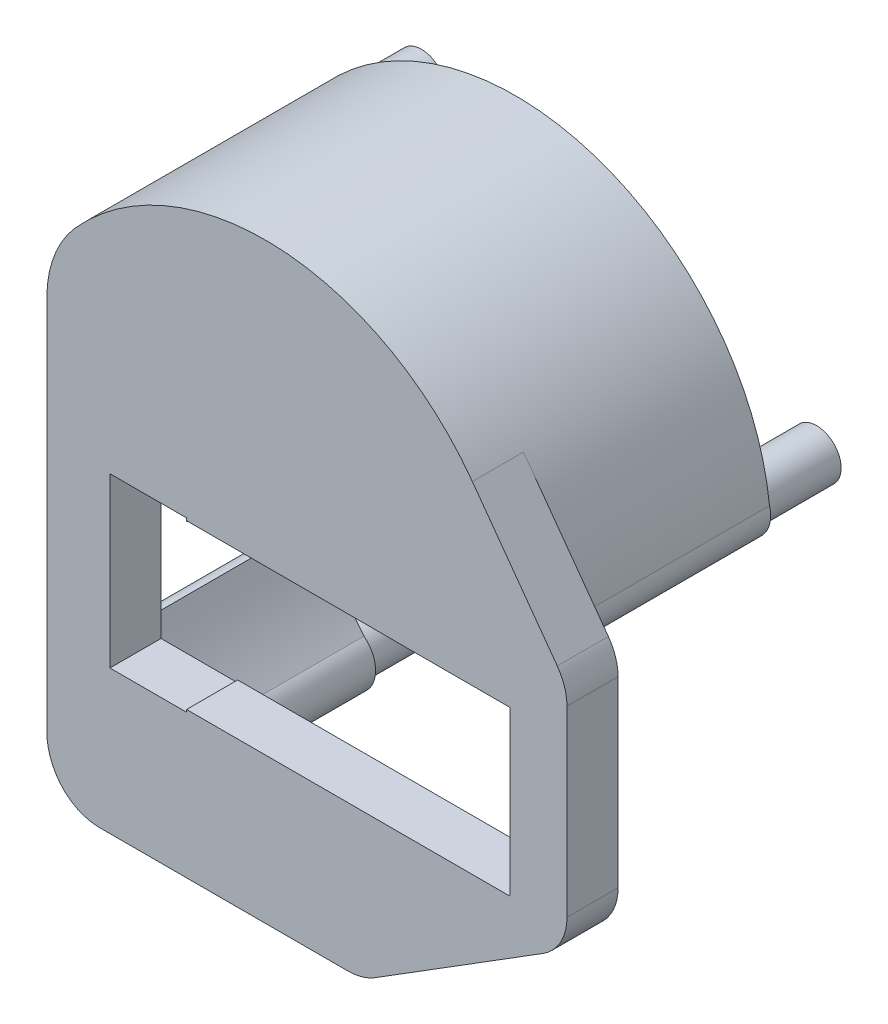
ISO-10303-21;
HEADER;
FILE_DESCRIPTION(('STEP AP214'),'2;1');
FILE_NAME('part.step','',(''),(''),'','','');
FILE_SCHEMA(('AUTOMOTIVE_DESIGN { 1 0 10303 214 1 1 1 1 }'));
ENDSEC;
DATA;
#1=APPLICATION_CONTEXT('core data for automotive mechanical design processes');
#2=APPLICATION_PROTOCOL_DEFINITION('international standard','automotive_design',2000,#1);
#3=PRODUCT_CONTEXT('',#1,'mechanical');
#4=PRODUCT('Part','Part','',(#3));
#5=PRODUCT_RELATED_PRODUCT_CATEGORY('part','',(#4));
#6=PRODUCT_DEFINITION_FORMATION('','',#4);
#7=PRODUCT_DEFINITION_CONTEXT('part definition',#1,'design');
#8=PRODUCT_DEFINITION('design','',#6,#7);
#9=PRODUCT_DEFINITION_SHAPE('','',#8);
#10=(LENGTH_UNIT() NAMED_UNIT(*) SI_UNIT(.MILLI.,.METRE.));
#11=(NAMED_UNIT(*) PLANE_ANGLE_UNIT() SI_UNIT($,.RADIAN.));
#12=(NAMED_UNIT(*) SI_UNIT($,.STERADIAN.) SOLID_ANGLE_UNIT());
#13=UNCERTAINTY_MEASURE_WITH_UNIT(LENGTH_MEASURE(1.E-05),#10,'distance_accuracy_value','');
#14=(GEOMETRIC_REPRESENTATION_CONTEXT(3) GLOBAL_UNCERTAINTY_ASSIGNED_CONTEXT((#13)) GLOBAL_UNIT_ASSIGNED_CONTEXT((#10,
#11,#12)) REPRESENTATION_CONTEXT('',''));
#15=CARTESIAN_POINT('',(0.,0.,0.));
#16=DIRECTION('',(0.,0.,1.));
#17=DIRECTION('',(1.,0.,0.));
#18=AXIS2_PLACEMENT_3D('',#15,#16,#17);
#19=CARTESIAN_POINT('',(11.390212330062,3.27386162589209,9.525));
#20=DIRECTION('',(0.,0.,1.));
#21=DIRECTION('',(1.,0.,0.));
#22=AXIS2_PLACEMENT_3D('',#19,#20,#21);
#23=CYLINDRICAL_SURFACE('',#22,47.38720216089);
#24=DIRECTION('',(0.,0.,1.));
#25=VECTOR('',#24,1.);
#26=CARTESIAN_POINT('',(-24.1500795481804,34.6176741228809,0.));
#27=LINE('',#26,#25);
#28=CARTESIAN_POINT('',(-24.1500795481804,34.6176741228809,9.525));
#29=VERTEX_POINT('',#28);
#30=CARTESIAN_POINT('',(-24.1500795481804,34.6176741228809,40.6024000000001));
#31=VERTEX_POINT('',#30);
#32=EDGE_CURVE('E338',#29,#31,#27,.T.);
#33=ORIENTED_EDGE('',*,*,#32,.T.);
#34=CARTESIAN_POINT('',(11.390212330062,3.27386162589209,40.6024000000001));
#35=DIRECTION('',(0.,0.,1.));
#36=DIRECTION('',(1.,0.,0.));
#37=AXIS2_PLACEMENT_3D('',#34,#35,#36);
#38=CIRCLE('',#37,47.38720216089);
#39=CARTESIAN_POINT('',(-23.959631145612,34.8323073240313,40.6024000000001));
#40=VERTEX_POINT('',#39);
#41=EDGE_CURVE('E714',#40,#31,#38,.T.);
#42=ORIENTED_EDGE('',*,*,#41,.F.);
#43=DIRECTION('',(0.,0.,1.));
#44=VECTOR('',#43,1.);
#45=CARTESIAN_POINT('',(-23.9596311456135,34.8323073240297,9.525));
#46=LINE('',#45,#44);
#47=CARTESIAN_POINT('',(-23.9596311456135,34.8323073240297,9.525));
#48=VERTEX_POINT('',#47);
#49=EDGE_CURVE('E402',#48,#40,#46,.T.);
#50=ORIENTED_EDGE('',*,*,#49,.F.);
#51=CARTESIAN_POINT('',(11.390212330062,3.27386162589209,9.525));
#52=DIRECTION('',(0.,0.,-1.));
#53=DIRECTION('',(-1.,0.,0.));
#54=AXIS2_PLACEMENT_3D('',#51,#52,#53);
#55=CIRCLE('',#54,47.38720216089);
#56=EDGE_CURVE('E420',#29,#48,#55,.T.);
#57=ORIENTED_EDGE('',*,*,#56,.F.);
#58=EDGE_LOOP('',(#33,#42,#50,#57));
#59=FACE_BOUND('',#58,.T.);
#60=ADVANCED_FACE('F35',(#59),#23,.T.);
#61=DIRECTION('',(0.,0.,1.));
#62=VECTOR('',#61,1.);
#63=CARTESIAN_POINT('',(-26.0023648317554,-25.8352795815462,0.));
#64=LINE('',#63,#62);
#65=CARTESIAN_POINT('',(-26.0023648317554,-25.8352795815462,9.525));
#66=VERTEX_POINT('',#65);
#67=CARTESIAN_POINT('',(-26.0023648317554,-25.8352795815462,34.2524000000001));
#68=VERTEX_POINT('',#67);
#69=EDGE_CURVE('E353',#66,#68,#64,.T.);
#70=ORIENTED_EDGE('',*,*,#69,.F.);
#71=CARTESIAN_POINT('',(-23.959631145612,-28.2845840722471,9.525));
#72=VERTEX_POINT('',#71);
#73=EDGE_CURVE('E423',#72,#66,#55,.T.);
#74=ORIENTED_EDGE('',*,*,#73,.F.);
#75=DIRECTION('',(0.,0.,1.));
#76=VECTOR('',#75,1.);
#77=CARTESIAN_POINT('',(-23.959631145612,-28.2845840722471,9.525));
#78=LINE('',#77,#76);
#79=CARTESIAN_POINT('',(-23.9596311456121,-28.2845840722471,34.2524000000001));
#80=VERTEX_POINT('',#79);
#81=EDGE_CURVE('E387',#72,#80,#78,.T.);
#82=ORIENTED_EDGE('',*,*,#81,.T.);
#83=CARTESIAN_POINT('',(11.390212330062,3.27386162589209,34.2524000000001));
#84=DIRECTION('',(0.,0.,-1.));
#85=DIRECTION('',(-1.,0.,0.));
#86=AXIS2_PLACEMENT_3D('',#83,#84,#85);
#87=CIRCLE('',#86,47.38720216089);
#88=EDGE_CURVE('E461',#80,#68,#87,.T.);
#89=ORIENTED_EDGE('',*,*,#88,.T.);
#90=EDGE_LOOP('',(#70,#74,#82,#89));
#91=FACE_BOUND('',#90,.T.);
#92=ADVANCED_FACE('F491',(#91),#23,.T.);
#93=CARTESIAN_POINT('',(11.390212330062,3.27386162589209,9.525));
#94=DIRECTION('',(0.,0.,1.));
#95=DIRECTION('',(1.,0.,0.));
#96=AXIS2_PLACEMENT_3D('',#93,#94,#95);
#97=CYLINDRICAL_SURFACE('',#96,39.8990643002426);
#98=CARTESIAN_POINT('',(11.390212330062,3.27386162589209,9.525));
#99=DIRECTION('',(0.,0.,1.));
#100=DIRECTION('',(-1.,0.,0.));
#101=AXIS2_PLACEMENT_3D('',#98,#99,#100);
#102=CIRCLE('',#101,39.8990643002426);
#103=CARTESIAN_POINT('',(-25.1236889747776,-12.8093701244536,9.525));
#104=VERTEX_POINT('',#103);
#105=CARTESIAN_POINT('',(-19.220368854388,-22.3176926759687,9.525));
#106=VERTEX_POINT('',#105);
#107=EDGE_CURVE('E283',#104,#106,#102,.T.);
#108=ORIENTED_EDGE('',*,*,#107,.F.);
#109=DIRECTION('',(0.,0.,1.));
#110=VECTOR('',#109,1.);
#111=CARTESIAN_POINT('',(-25.1236889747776,-12.8093701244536,9.525));
#112=LINE('',#111,#110);
#113=CARTESIAN_POINT('',(-25.1236889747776,-12.8093701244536,29.8262000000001));
#114=VERTEX_POINT('',#113);
#115=EDGE_CURVE('E297',#114,#104,#112,.F.);
#116=ORIENTED_EDGE('',*,*,#115,.F.);
#117=CARTESIAN_POINT('',(11.390212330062,3.27386162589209,29.8262000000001));
#118=DIRECTION('',(0.,0.,-1.));
#119=DIRECTION('',(0.,1.,0.));
#120=AXIS2_PLACEMENT_3D('',#117,#118,#119);
#121=CIRCLE('',#120,39.8990643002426);
#122=CARTESIAN_POINT('',(-27.559,-5.38028136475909,29.8262000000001));
#123=VERTEX_POINT('',#122);
#124=EDGE_CURVE('E311',#123,#114,#121,.F.);
#125=ORIENTED_EDGE('',*,*,#124,.F.);
#126=DIRECTION('',(0.,0.,1.));
#127=VECTOR('',#126,1.);
#128=CARTESIAN_POINT('',(-27.559,-5.38028136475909,9.525));
#129=LINE('',#128,#127);
#130=CARTESIAN_POINT('',(-27.559,-5.38028136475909,34.2524000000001));
#131=VERTEX_POINT('',#130);
#132=EDGE_CURVE('E328',#131,#123,#129,.F.);
#133=ORIENTED_EDGE('',*,*,#132,.F.);
#134=CARTESIAN_POINT('',(11.390212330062,3.27386162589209,34.2524000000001));
#135=DIRECTION('',(0.,0.,-1.));
#136=DIRECTION('',(-1.,0.,0.));
#137=AXIS2_PLACEMENT_3D('',#134,#135,#136);
#138=CIRCLE('',#137,39.8990643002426);
#139=CARTESIAN_POINT('',(-19.2203688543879,-22.3176926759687,34.2524000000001));
#140=VERTEX_POINT('',#139);
#141=EDGE_CURVE('E453',#131,#140,#138,.F.);
#142=ORIENTED_EDGE('',*,*,#141,.T.);
#143=DIRECTION('',(0.,0.,1.));
#144=VECTOR('',#143,1.);
#145=CARTESIAN_POINT('',(-19.220368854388,-22.3176926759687,9.525));
#146=LINE('',#145,#144);
#147=EDGE_CURVE('E299',#106,#140,#146,.T.);
#148=ORIENTED_EDGE('',*,*,#147,.F.);
#149=EDGE_LOOP('',(#108,#116,#125,#133,#142,#148));
#150=FACE_BOUND('',#149,.T.);
#151=ADVANCED_FACE('F295',(#150),#97,.F.);
#152=DIRECTION('',(0.,0.,1.));
#153=VECTOR('',#152,1.);
#154=CARTESIAN_POINT('',(-21.8843612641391,25.2906298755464,9.525));
#155=LINE('',#154,#153);
#156=CARTESIAN_POINT('',(-21.8843612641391,25.2906298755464,9.525));
#157=VERTEX_POINT('',#156);
#158=CARTESIAN_POINT('',(-21.8843612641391,25.2906298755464,29.8262000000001));
#159=VERTEX_POINT('',#158);
#160=EDGE_CURVE('E373',#157,#159,#155,.T.);
#161=ORIENTED_EDGE('',*,*,#160,.F.);
#162=CARTESIAN_POINT('',(-19.220368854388,28.8654159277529,9.525));
#163=VERTEX_POINT('',#162);
#164=EDGE_CURVE('E301',#163,#157,#102,.T.);
#165=ORIENTED_EDGE('',*,*,#164,.F.);
#166=DIRECTION('',(0.,0.,1.));
#167=VECTOR('',#166,1.);
#168=CARTESIAN_POINT('',(-19.220368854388,28.8654159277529,9.525));
#169=LINE('',#168,#167);
#170=CARTESIAN_POINT('',(-19.220368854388,28.8654159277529,34.2524000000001));
#171=VERTEX_POINT('',#170);
#172=EDGE_CURVE('E395',#163,#171,#169,.T.);
#173=ORIENTED_EDGE('',*,*,#172,.T.);
#174=CARTESIAN_POINT('',(-27.559,11.9280046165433,34.2524000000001));
#175=VERTEX_POINT('',#174);
#176=EDGE_CURVE('E449',#171,#175,#138,.F.);
#177=ORIENTED_EDGE('',*,*,#176,.T.);
#178=DIRECTION('',(0.,0.,1.));
#179=VECTOR('',#178,1.);
#180=CARTESIAN_POINT('',(-27.559,11.9280046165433,9.525));
#181=LINE('',#180,#179);
#182=CARTESIAN_POINT('',(-27.559,11.9280046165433,29.8262000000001));
#183=VERTEX_POINT('',#182);
#184=EDGE_CURVE('E337',#183,#175,#181,.T.);
#185=ORIENTED_EDGE('',*,*,#184,.F.);
#186=EDGE_CURVE('E307',#159,#183,#121,.F.);
#187=ORIENTED_EDGE('',*,*,#186,.F.);
#188=EDGE_LOOP('',(#161,#165,#173,#177,#185,#187));
#189=FACE_BOUND('',#188,.T.);
#190=ADVANCED_FACE('F379',(#189),#97,.F.);
#191=CARTESIAN_POINT('',(5.489183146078,8.38668222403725,9.525));
#192=DIRECTION('',(0.,0.,-1.));
#193=DIRECTION('',(-1.,0.,0.));
#194=AXIS2_PLACEMENT_3D('',#191,#192,#193);
#195=PLANE('',#194);
#196=DIRECTION('',(1.,0.,0.));
#197=VECTOR('',#196,1.);
#198=CARTESIAN_POINT('',(5.489183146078,25.2906298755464,9.525));
#199=LINE('',#198,#197);
#200=CARTESIAN_POINT('',(-24.7770254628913,25.2906298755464,9.525));
#201=VERTEX_POINT('',#200);
#202=EDGE_CURVE('E365',#201,#157,#199,.T.);
#203=ORIENTED_EDGE('',*,*,#202,.F.);
#204=CARTESIAN_POINT('',(-24.7770254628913,27.8306298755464,9.525));
#205=DIRECTION('',(0.,0.,-1.));
#206=DIRECTION('',(-1.,0.,0.));
#207=AXIS2_PLACEMENT_3D('',#204,#205,#206);
#208=CIRCLE('',#207,2.54);
#209=CARTESIAN_POINT('',(-27.2629347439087,28.352027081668,9.525));
#210=VERTEX_POINT('',#209);
#211=EDGE_CURVE('E57',#201,#210,#208,.T.);
#212=ORIENTED_EDGE('',*,*,#211,.T.);
#213=CARTESIAN_POINT('',(-13.6563238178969,25.498162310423,9.525));
#214=DIRECTION('',(0.,0.,-1.));
#215=DIRECTION('',(-1.,0.,0.));
#216=AXIS2_PLACEMENT_3D('',#213,#214,#215);
#217=CIRCLE('',#216,13.9026761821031);
#218=EDGE_CURVE('E773',#210,#29,#217,.T.);
#219=ORIENTED_EDGE('',*,*,#218,.T.);
#220=ORIENTED_EDGE('',*,*,#56,.T.);
#221=CARTESIAN_POINT('',(-0.411846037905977,13.4995028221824,9.525));
#222=DIRECTION('',(0.,0.,-1.));
#223=DIRECTION('',(-1.,0.,0.));
#224=AXIS2_PLACEMENT_3D('',#221,#222,#223);
#225=CIRCLE('',#224,31.7739945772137);
#226=CARTESIAN_POINT('',(31.1778201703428,16.9170633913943,9.525));
#227=VERTEX_POINT('',#226);
#228=EDGE_CURVE('E431',#48,#227,#225,.T.);
#229=ORIENTED_EDGE('',*,*,#228,.T.);
#230=CARTESIAN_POINT('',(27.5071229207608,15.8962393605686,9.525));
#231=DIRECTION('',(0.,0.,-1.));
#232=DIRECTION('',(-1.,0.,0.));
#233=AXIS2_PLACEMENT_3D('',#230,#231,#232);
#234=CIRCLE('',#233,3.81);
#235=CARTESIAN_POINT('',(23.8364256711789,14.8754153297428,9.525));
#236=VERTEX_POINT('',#235);
#237=EDGE_CURVE('E432',#227,#236,#234,.T.);
#238=ORIENTED_EDGE('',*,*,#237,.T.);
#239=CARTESIAN_POINT('',(-0.411846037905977,13.4995028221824,9.525));
#240=DIRECTION('',(0.,0.,1.));
#241=DIRECTION('',(-1.,0.,0.));
#242=AXIS2_PLACEMENT_3D('',#239,#240,#241);
#243=CIRCLE('',#242,24.2872768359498);
#244=EDGE_CURVE('E302',#236,#163,#243,.T.);
#245=ORIENTED_EDGE('',*,*,#244,.T.);
#246=ORIENTED_EDGE('',*,*,#164,.T.);
#247=EDGE_LOOP('',(#203,#212,#219,#220,#229,#238,#245,#246));
#248=FACE_BOUND('',#247,.T.);
#249=CARTESIAN_POINT('',(-21.59,31.8488616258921,9.525));
#250=DIRECTION('',(0.,0.,-1.));
#251=DIRECTION('',(-1.,0.,0.));
#252=AXIS2_PLACEMENT_3D('',#249,#250,#251);
#253=CIRCLE('',#252,3.048);
#254=CARTESIAN_POINT('',(-24.638,31.8488616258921,9.525));
#255=VERTEX_POINT('',#254);
#256=EDGE_CURVE('E404',#255,#255,#253,.T.);
#257=ORIENTED_EDGE('',*,*,#256,.F.);
#258=EDGE_LOOP('',(#257));
#259=FACE_BOUND('',#258,.T.);
#260=CARTESIAN_POINT('',(27.5071229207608,15.8962393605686,9.525));
#261=DIRECTION('',(0.,0.,-1.));
#262=DIRECTION('',(-1.,0.,0.));
#263=AXIS2_PLACEMENT_3D('',#260,#261,#262);
#264=CIRCLE('',#263,3.048);
#265=CARTESIAN_POINT('',(24.4591229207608,15.8962393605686,9.525));
#266=VERTEX_POINT('',#265);
#267=EDGE_CURVE('E418',#266,#266,#264,.F.);
#268=ORIENTED_EDGE('',*,*,#267,.T.);
#269=EDGE_LOOP('',(#268));
#270=FACE_BOUND('',#269,.T.);
#271=ADVANCED_FACE('F382',(#248,#259,#270),#195,.T.);
#272=CARTESIAN_POINT('',(0.,0.,34.2524000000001));
#273=DIRECTION('',(0.,0.,1.));
#274=DIRECTION('',(1.,0.,0.));
#275=AXIS2_PLACEMENT_3D('',#272,#273,#274);
#276=PLANE('',#275);
#277=DIRECTION('',(0.,-1.,0.));
#278=VECTOR('',#277,1.);
#279=CARTESIAN_POINT('',(29.9465999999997,0.,34.2524000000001));
#280=LINE('',#279,#278);
#281=CARTESIAN_POINT('',(29.9465999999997,-10.0965000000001,34.2524000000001));
#282=VERTEX_POINT('',#281);
#283=CARTESIAN_POINT('',(29.9465999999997,-10.1600000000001,34.2524000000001));
#284=VERTEX_POINT('',#283);
#285=EDGE_CURVE('E658',#282,#284,#280,.T.);
#286=ORIENTED_EDGE('',*,*,#285,.F.);
#287=DIRECTION('',(-1.,0.,0.));
#288=VECTOR('',#287,1.);
#289=CARTESIAN_POINT('',(30.0100999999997,-10.0965000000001,34.2524000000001));
#290=LINE('',#289,#288);
#291=CARTESIAN_POINT('',(30.0100999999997,-10.0965,34.2524000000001));
#292=VERTEX_POINT('',#291);
#293=EDGE_CURVE('E778',#292,#282,#290,.T.);
#294=ORIENTED_EDGE('',*,*,#293,.F.);
#295=DIRECTION('',(0.,-1.,0.));
#296=VECTOR('',#295,1.);
#297=CARTESIAN_POINT('',(30.0100999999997,10.16,34.2524000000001));
#298=LINE('',#297,#296);
#299=CARTESIAN_POINT('',(30.0100999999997,10.16,34.2524000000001));
#300=VERTEX_POINT('',#299);
#301=EDGE_CURVE('E771',#300,#292,#298,.T.);
#302=ORIENTED_EDGE('',*,*,#301,.F.);
#303=DIRECTION('',(1.,0.,0.));
#304=VECTOR('',#303,1.);
#305=CARTESIAN_POINT('',(30.0100999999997,10.16,34.2524000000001));
#306=LINE('',#305,#304);
#307=CARTESIAN_POINT('',(-10.1346000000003,10.16,34.2524000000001));
#308=VERTEX_POINT('',#307);
#309=EDGE_CURVE('E630',#308,#300,#306,.T.);
#310=ORIENTED_EDGE('',*,*,#309,.F.);
#311=DIRECTION('',(0.,1.,0.));
#312=VECTOR('',#311,1.);
#313=CARTESIAN_POINT('',(-10.1346000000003,10.16,34.2524000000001));
#314=LINE('',#313,#312);
#315=CARTESIAN_POINT('',(-10.1346000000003,10.0964999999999,34.2524000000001));
#316=VERTEX_POINT('',#315);
#317=EDGE_CURVE('E768',#316,#308,#314,.T.);
#318=ORIENTED_EDGE('',*,*,#317,.F.);
#319=DIRECTION('',(-1.,0.,0.));
#320=VECTOR('',#319,1.);
#321=CARTESIAN_POINT('',(0.,10.0964999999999,34.2524000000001));
#322=LINE('',#321,#320);
#323=CARTESIAN_POINT('',(-10.1981000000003,10.0964999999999,34.2524000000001));
#324=VERTEX_POINT('',#323);
#325=EDGE_CURVE('E656',#316,#324,#322,.T.);
#326=ORIENTED_EDGE('',*,*,#325,.T.);
#327=DIRECTION('',(0.,-1.,0.));
#328=VECTOR('',#327,1.);
#329=CARTESIAN_POINT('',(-10.1981000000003,0.,34.2524000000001));
#330=LINE('',#329,#328);
#331=CARTESIAN_POINT('',(-10.1981000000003,10.4583647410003,34.2524000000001));
#332=VERTEX_POINT('',#331);
#333=EDGE_CURVE('E653',#332,#324,#330,.T.);
#334=ORIENTED_EDGE('',*,*,#333,.F.);
#335=DIRECTION('',(1.,0.,0.));
#336=VECTOR('',#335,1.);
#337=CARTESIAN_POINT('',(0.,10.4583647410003,34.2524000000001));
#338=LINE('',#337,#336);
#339=CARTESIAN_POINT('',(-19.7231000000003,10.4583647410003,34.2524000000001));
#340=VERTEX_POINT('',#339);
#341=EDGE_CURVE('E650',#340,#332,#338,.T.);
#342=ORIENTED_EDGE('',*,*,#341,.F.);
#343=DIRECTION('',(0.,1.,0.));
#344=VECTOR('',#343,1.);
#345=CARTESIAN_POINT('',(-19.7231000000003,0.,34.2524000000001));
#346=LINE('',#345,#344);
#347=CARTESIAN_POINT('',(-19.7231000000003,-10.4583647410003,34.2524000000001));
#348=VERTEX_POINT('',#347);
#349=EDGE_CURVE('E666',#348,#340,#346,.T.);
#350=ORIENTED_EDGE('',*,*,#349,.F.);
#351=DIRECTION('',(-1.,0.,0.));
#352=VECTOR('',#351,1.);
#353=CARTESIAN_POINT('',(0.,-10.4583647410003,34.2524000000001));
#354=LINE('',#353,#352);
#355=CARTESIAN_POINT('',(-10.1981000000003,-10.4583647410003,34.2524000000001));
#356=VERTEX_POINT('',#355);
#357=EDGE_CURVE('E664',#356,#348,#354,.T.);
#358=ORIENTED_EDGE('',*,*,#357,.F.);
#359=DIRECTION('',(0.,-1.,0.));
#360=VECTOR('',#359,1.);
#361=CARTESIAN_POINT('',(-10.1981000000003,0.,34.2524000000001));
#362=LINE('',#361,#360);
#363=CARTESIAN_POINT('',(-10.1981000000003,-10.1600000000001,34.2524000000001));
#364=VERTEX_POINT('',#363);
#365=EDGE_CURVE('E662',#364,#356,#362,.T.);
#366=ORIENTED_EDGE('',*,*,#365,.F.);
#367=DIRECTION('',(-1.,0.,0.));
#368=VECTOR('',#367,1.);
#369=CARTESIAN_POINT('',(0.,-10.1600000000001,34.2524000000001));
#370=LINE('',#369,#368);
#371=EDGE_CURVE('E660',#284,#364,#370,.T.);
#372=ORIENTED_EDGE('',*,*,#371,.F.);
#373=EDGE_LOOP('',(#286,#294,#302,#310,#318,#326,#334,#342,#350,#358,#366,#372));
#374=FACE_BOUND('',#373,.T.);
#375=DIRECTION('',(0.,-1.,0.));
#376=VECTOR('',#375,1.);
#377=CARTESIAN_POINT('',(-27.559,0.,34.2524000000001));
#378=LINE('',#377,#376);
#379=EDGE_CURVE('E333',#175,#131,#378,.T.);
#380=ORIENTED_EDGE('',*,*,#379,.F.);
#381=ORIENTED_EDGE('',*,*,#176,.F.);
#382=CARTESIAN_POINT('',(-0.411846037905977,13.4995028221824,34.2524000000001));
#383=DIRECTION('',(0.,0.,-1.));
#384=DIRECTION('',(-1.,0.,0.));
#385=AXIS2_PLACEMENT_3D('',#382,#383,#384);
#386=CIRCLE('',#385,24.2872768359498);
#387=CARTESIAN_POINT('',(23.8364256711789,14.8754153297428,34.2524000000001));
#388=VERTEX_POINT('',#387);
#389=EDGE_CURVE('E446',#388,#171,#386,.F.);
#390=ORIENTED_EDGE('',*,*,#389,.F.);
#391=CARTESIAN_POINT('',(27.5071229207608,15.8962393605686,34.2524000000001));
#392=DIRECTION('',(0.,0.,-1.));
#393=DIRECTION('',(-1.,0.,0.));
#394=AXIS2_PLACEMENT_3D('',#391,#392,#393);
#395=CIRCLE('',#394,3.81);
#396=CARTESIAN_POINT('',(31.1778201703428,16.9170633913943,34.2524000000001));
#397=VERTEX_POINT('',#396);
#398=EDGE_CURVE('E441',#397,#388,#395,.T.);
#399=ORIENTED_EDGE('',*,*,#398,.F.);
#400=CARTESIAN_POINT('',(-0.411846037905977,13.4995028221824,34.2524000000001));
#401=DIRECTION('',(0.,0.,-1.));
#402=DIRECTION('',(-1.,0.,0.));
#403=AXIS2_PLACEMENT_3D('',#400,#401,#402);
#404=CIRCLE('',#403,31.7739945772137);
#405=CARTESIAN_POINT('',(25.3221537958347,32.1367768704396,34.2524000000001));
#406=VERTEX_POINT('',#405);
#407=EDGE_CURVE('E464',#406,#397,#404,.T.);
#408=ORIENTED_EDGE('',*,*,#407,.F.);
#409=DIRECTION('',(0.586557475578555,-0.809907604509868,0.));
#410=VECTOR('',#409,1.);
#411=CARTESIAN_POINT('',(31.876887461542,23.0861230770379,34.2524000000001));
#412=LINE('',#411,#410);
#413=CARTESIAN_POINT('',(35.8769132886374,17.5629621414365,34.2524000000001));
#414=VERTEX_POINT('',#413);
#415=EDGE_CURVE('E615',#406,#414,#412,.T.);
#416=ORIENTED_EDGE('',*,*,#415,.T.);
#417=CARTESIAN_POINT('',(30.7339999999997,13.8383221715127,34.2524000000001));
#418=DIRECTION('',(0.,0.,1.));
#419=DIRECTION('',(1.,0.,0.));
#420=AXIS2_PLACEMENT_3D('',#417,#418,#419);
#421=CIRCLE('',#420,6.35);
#422=CARTESIAN_POINT('',(37.0839999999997,13.8383221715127,34.2524000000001));
#423=VERTEX_POINT('',#422);
#424=EDGE_CURVE('E648',#423,#414,#421,.T.);
#425=ORIENTED_EDGE('',*,*,#424,.F.);
#426=DIRECTION('',(0.,1.,0.));
#427=VECTOR('',#426,1.);
#428=CARTESIAN_POINT('',(37.0839999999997,0.,34.2524000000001));
#429=LINE('',#428,#427);
#430=CARTESIAN_POINT('',(37.0839999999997,-8.89011154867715,34.2524000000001));
#431=VERTEX_POINT('',#430);
#432=EDGE_CURVE('E646',#431,#423,#429,.T.);
#433=ORIENTED_EDGE('',*,*,#432,.F.);
#434=CARTESIAN_POINT('',(30.7339999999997,-8.89011154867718,34.2524000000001));
#435=DIRECTION('',(0.,0.,1.));
#436=DIRECTION('',(1.,0.,0.));
#437=AXIS2_PLACEMENT_3D('',#434,#435,#436);
#438=CIRCLE('',#437,6.35);
#439=CARTESIAN_POINT('',(34.0994932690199,-14.2749007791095,34.2524000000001));
#440=VERTEX_POINT('',#439);
#441=EDGE_CURVE('E644',#440,#431,#438,.T.);
#442=ORIENTED_EDGE('',*,*,#441,.F.);
#443=DIRECTION('',(0.847998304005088,0.52999894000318,0.));
#444=VECTOR('',#443,1.);
#445=CARTESIAN_POINT('',(15.9941950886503,-25.5907121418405,34.2524000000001));
#446=LINE('',#445,#444);
#447=CARTESIAN_POINT('',(13.2283372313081,-27.3193733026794,34.2524000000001));
#448=VERTEX_POINT('',#447);
#449=EDGE_CURVE('E642',#448,#440,#446,.T.);
#450=ORIENTED_EDGE('',*,*,#449,.F.);
#451=CARTESIAN_POINT('',(9.86284396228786,-21.9345840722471,34.2524000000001));
#452=DIRECTION('',(0.,0.,1.));
#453=DIRECTION('',(1.,0.,0.));
#454=AXIS2_PLACEMENT_3D('',#451,#452,#453);
#455=CIRCLE('',#454,6.35);
#456=CARTESIAN_POINT('',(9.86284396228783,-28.2845840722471,34.2524000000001));
#457=VERTEX_POINT('',#456);
#458=EDGE_CURVE('E639',#448,#457,#455,.F.);
#459=ORIENTED_EDGE('',*,*,#458,.T.);
#460=DIRECTION('',(1.,0.,0.));
#461=VECTOR('',#460,1.);
#462=CARTESIAN_POINT('',(0.,-28.2845840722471,34.2524000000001));
#463=LINE('',#462,#461);
#464=CARTESIAN_POINT('',(-19.2203688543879,-28.2845840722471,34.2524000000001));
#465=VERTEX_POINT('',#464);
#466=EDGE_CURVE('E628',#465,#457,#463,.T.);
#467=ORIENTED_EDGE('',*,*,#466,.F.);
#468=CARTESIAN_POINT('',(-21.59,-25.3011383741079,34.2524000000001));
#469=DIRECTION('',(0.,0.,-1.));
#470=DIRECTION('',(-1.,0.,0.));
#471=AXIS2_PLACEMENT_3D('',#468,#469,#470);
#472=CIRCLE('',#471,3.81);
#473=EDGE_CURVE('E455',#140,#465,#472,.T.);
#474=ORIENTED_EDGE('',*,*,#473,.F.);
#475=ORIENTED_EDGE('',*,*,#141,.F.);
#476=EDGE_LOOP('',(#380,#381,#390,#399,#408,#416,#425,#433,#442,#450,#459,#467,#474,#475));
#477=FACE_BOUND('',#476,.T.);
#478=ADVANCED_FACE('F414',(#374,#477),#276,.F.);
#479=CARTESIAN_POINT('',(-35.996989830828,25.2906298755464,29.8262000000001));
#480=DIRECTION('',(0.,0.,-1.));
#481=DIRECTION('',(0.,1.,0.));
#482=AXIS2_PLACEMENT_3D('',#479,#480,#481);
#483=PLANE('',#482);
#484=ORIENTED_EDGE('',*,*,#124,.T.);
#485=CARTESIAN_POINT('',(-25.019,-15.347211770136,29.8262000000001));
#486=DIRECTION('',(0.,0.,-1.));
#487=DIRECTION('',(0.,1.,0.));
#488=AXIS2_PLACEMENT_3D('',#485,#486,#487);
#489=CIRCLE('',#488,2.54);
#490=CARTESIAN_POINT('',(-27.559,-15.347211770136,29.8262000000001));
#491=VERTEX_POINT('',#490);
#492=EDGE_CURVE('E43',#114,#491,#489,.F.);
#493=ORIENTED_EDGE('',*,*,#492,.T.);
#494=DIRECTION('',(0.,1.,0.));
#495=VECTOR('',#494,1.);
#496=CARTESIAN_POINT('',(-27.559,25.2906298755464,29.8262000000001));
#497=LINE('',#496,#495);
#498=EDGE_CURVE('E323',#491,#123,#497,.T.);
#499=ORIENTED_EDGE('',*,*,#498,.T.);
#500=EDGE_LOOP('',(#484,#493,#499));
#501=FACE_BOUND('',#500,.T.);
#502=ADVANCED_FACE('F322',(#501),#483,.T.);
#503=ORIENTED_EDGE('',*,*,#186,.T.);
#504=CARTESIAN_POINT('',(-27.559,25.498162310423,29.8262000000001));
#505=VERTEX_POINT('',#504);
#506=EDGE_CURVE('E330',#183,#505,#497,.T.);
#507=ORIENTED_EDGE('',*,*,#506,.T.);
#508=CARTESIAN_POINT('',(-13.6563238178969,25.498162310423,29.8262000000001));
#509=DIRECTION('',(0.,0.,-1.));
#510=DIRECTION('',(0.,1.,0.));
#511=AXIS2_PLACEMENT_3D('',#508,#509,#510);
#512=CIRCLE('',#511,13.9026761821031);
#513=CARTESIAN_POINT('',(-27.2629347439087,28.352027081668,29.8262000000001));
#514=VERTEX_POINT('',#513);
#515=EDGE_CURVE('E49',#514,#505,#512,.F.);
#516=ORIENTED_EDGE('',*,*,#515,.F.);
#517=CARTESIAN_POINT('',(-24.7770254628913,27.8306298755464,29.8262000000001));
#518=DIRECTION('',(0.,0.,-1.));
#519=DIRECTION('',(0.,1.,0.));
#520=AXIS2_PLACEMENT_3D('',#517,#518,#519);
#521=CIRCLE('',#520,2.54);
#522=CARTESIAN_POINT('',(-24.7770254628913,25.2906298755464,29.8262000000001));
#523=VERTEX_POINT('',#522);
#524=EDGE_CURVE('E11',#514,#523,#521,.F.);
#525=ORIENTED_EDGE('',*,*,#524,.T.);
#526=DIRECTION('',(1.,0.,0.));
#527=VECTOR('',#526,1.);
#528=CARTESIAN_POINT('',(-35.996989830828,25.2906298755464,29.8262000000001));
#529=LINE('',#528,#527);
#530=EDGE_CURVE('E625',#523,#159,#529,.T.);
#531=ORIENTED_EDGE('',*,*,#530,.T.);
#532=EDGE_LOOP('',(#503,#507,#516,#525,#531));
#533=FACE_BOUND('',#532,.T.);
#534=ADVANCED_FACE('F540',(#533),#483,.T.);
#535=CARTESIAN_POINT('',(-35.996989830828,25.2906298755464,20.3012000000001));
#536=DIRECTION('',(0.,-1.,0.));
#537=DIRECTION('',(0.,0.,-1.));
#538=AXIS2_PLACEMENT_3D('',#535,#536,#537);
#539=PLANE('',#538);
#540=ORIENTED_EDGE('',*,*,#530,.F.);
#541=DIRECTION('',(0.,0.,1.));
#542=VECTOR('',#541,1.);
#543=CARTESIAN_POINT('',(-24.7770254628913,25.2906298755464,20.3012000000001));
#544=LINE('',#543,#542);
#545=EDGE_CURVE('E290',#523,#201,#544,.F.);
#546=ORIENTED_EDGE('',*,*,#545,.T.);
#547=ORIENTED_EDGE('',*,*,#202,.T.);
#548=ORIENTED_EDGE('',*,*,#160,.T.);
#549=EDGE_LOOP('',(#540,#546,#547,#548));
#550=FACE_BOUND('',#549,.T.);
#551=ADVANCED_FACE('F372',(#550),#539,.T.);
#552=CARTESIAN_POINT('',(-21.59,31.8488616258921,25.4));
#553=DIRECTION('',(0.,0.,-1.));
#554=DIRECTION('',(-1.,0.,0.));
#555=AXIS2_PLACEMENT_3D('',#552,#553,#554);
#556=CYLINDRICAL_SURFACE('',#555,3.048);
#557=ORIENTED_EDGE('',*,*,#256,.T.);
#558=EDGE_LOOP('',(#557));
#559=FACE_BOUND('',#558,.T.);
#560=CARTESIAN_POINT('',(-21.59,31.8488616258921,0.));
#561=DIRECTION('',(0.,0.,1.));
#562=DIRECTION('',(1.,0.,0.));
#563=AXIS2_PLACEMENT_3D('',#560,#561,#562);
#564=CIRCLE('',#563,3.048);
#565=CARTESIAN_POINT('',(-18.542,31.8488616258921,0.));
#566=VERTEX_POINT('',#565);
#567=EDGE_CURVE('E381',#566,#566,#564,.T.);
#568=ORIENTED_EDGE('',*,*,#567,.T.);
#569=EDGE_LOOP('',(#568));
#570=FACE_BOUND('',#569,.T.);
#571=ADVANCED_FACE('F410',(#559,#570),#556,.T.);
#572=CARTESIAN_POINT('',(-21.59,31.8488616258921,0.));
#573=DIRECTION('',(0.,0.,1.));
#574=DIRECTION('',(1.,0.,0.));
#575=AXIS2_PLACEMENT_3D('',#572,#573,#574);
#576=PLANE('',#575);
#577=ORIENTED_EDGE('',*,*,#567,.F.);
#578=EDGE_LOOP('',(#577));
#579=FACE_BOUND('',#578,.T.);
#580=ADVANCED_FACE('F501',(#579),#576,.F.);
#581=CARTESIAN_POINT('',(-0.411846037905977,13.4995028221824,9.525));
#582=DIRECTION('',(0.,0.,1.));
#583=DIRECTION('',(1.,0.,0.));
#584=AXIS2_PLACEMENT_3D('',#581,#582,#583);
#585=CYLINDRICAL_SURFACE('',#584,31.7739945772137);
#586=ORIENTED_EDGE('',*,*,#49,.T.);
#587=CARTESIAN_POINT('',(-0.411846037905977,13.4995028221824,40.6024000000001));
#588=DIRECTION('',(0.,0.,1.));
#589=DIRECTION('',(1.,0.,0.));
#590=AXIS2_PLACEMENT_3D('',#587,#588,#589);
#591=CIRCLE('',#590,31.7739945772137);
#592=CARTESIAN_POINT('',(25.3221537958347,32.1367768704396,40.6024000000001));
#593=VERTEX_POINT('',#592);
#594=EDGE_CURVE('E711',#593,#40,#591,.T.);
#595=ORIENTED_EDGE('',*,*,#594,.F.);
#596=DIRECTION('',(0.,0.,-1.));
#597=VECTOR('',#596,1.);
#598=CARTESIAN_POINT('',(25.3221537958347,32.1367768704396,40.6024000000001));
#599=LINE('',#598,#597);
#600=EDGE_CURVE('E618',#593,#406,#599,.T.);
#601=ORIENTED_EDGE('',*,*,#600,.T.);
#602=ORIENTED_EDGE('',*,*,#407,.T.);
#603=DIRECTION('',(0.,0.,1.));
#604=VECTOR('',#603,1.);
#605=CARTESIAN_POINT('',(31.1778201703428,16.9170633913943,9.525));
#606=LINE('',#605,#604);
#607=EDGE_CURVE('E399',#227,#397,#606,.T.);
#608=ORIENTED_EDGE('',*,*,#607,.F.);
#609=ORIENTED_EDGE('',*,*,#228,.F.);
#610=EDGE_LOOP('',(#586,#595,#601,#602,#608,#609));
#611=FACE_BOUND('',#610,.T.);
#612=ADVANCED_FACE('F499',(#611),#585,.T.);
#613=CARTESIAN_POINT('',(27.5071229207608,15.8962393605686,9.525));
#614=DIRECTION('',(0.,0.,1.));
#615=DIRECTION('',(1.,0.,0.));
#616=AXIS2_PLACEMENT_3D('',#613,#614,#615);
#617=CYLINDRICAL_SURFACE('',#616,3.81);
#618=ORIENTED_EDGE('',*,*,#607,.T.);
#619=ORIENTED_EDGE('',*,*,#398,.T.);
#620=DIRECTION('',(0.,0.,1.));
#621=VECTOR('',#620,1.);
#622=CARTESIAN_POINT('',(23.8364256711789,14.8754153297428,9.525));
#623=LINE('',#622,#621);
#624=EDGE_CURVE('E397',#236,#388,#623,.T.);
#625=ORIENTED_EDGE('',*,*,#624,.F.);
#626=ORIENTED_EDGE('',*,*,#237,.F.);
#627=EDGE_LOOP('',(#618,#619,#625,#626));
#628=FACE_BOUND('',#627,.T.);
#629=ADVANCED_FACE('F439',(#628),#617,.T.);
#630=CARTESIAN_POINT('',(-0.411846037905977,13.4995028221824,9.525));
#631=DIRECTION('',(0.,0.,1.));
#632=DIRECTION('',(1.,0.,0.));
#633=AXIS2_PLACEMENT_3D('',#630,#631,#632);
#634=CYLINDRICAL_SURFACE('',#633,24.2872768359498);
#635=ORIENTED_EDGE('',*,*,#624,.T.);
#636=ORIENTED_EDGE('',*,*,#389,.T.);
#637=ORIENTED_EDGE('',*,*,#172,.F.);
#638=ORIENTED_EDGE('',*,*,#244,.F.);
#639=EDGE_LOOP('',(#635,#636,#637,#638));
#640=FACE_BOUND('',#639,.T.);
#641=ADVANCED_FACE('F445',(#640),#634,.F.);
#642=CARTESIAN_POINT('',(-21.59,-25.3011383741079,9.525));
#643=DIRECTION('',(0.,0.,1.));
#644=DIRECTION('',(1.,0.,0.));
#645=AXIS2_PLACEMENT_3D('',#642,#643,#644);
#646=CYLINDRICAL_SURFACE('',#645,3.81);
#647=ORIENTED_EDGE('',*,*,#147,.T.);
#648=ORIENTED_EDGE('',*,*,#473,.T.);
#649=EDGE_CURVE('E452',#465,#80,#472,.T.);
#650=ORIENTED_EDGE('',*,*,#649,.T.);
#651=ORIENTED_EDGE('',*,*,#81,.F.);
#652=CARTESIAN_POINT('',(-21.59,-25.3011383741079,9.525));
#653=DIRECTION('',(0.,0.,-1.));
#654=DIRECTION('',(-1.,0.,0.));
#655=AXIS2_PLACEMENT_3D('',#652,#653,#654);
#656=CIRCLE('',#655,3.81);
#657=EDGE_CURVE('E386',#106,#72,#656,.T.);
#658=ORIENTED_EDGE('',*,*,#657,.F.);
#659=EDGE_LOOP('',(#647,#648,#650,#651,#658));
#660=FACE_BOUND('',#659,.T.);
#661=ADVANCED_FACE('F839',(#660),#646,.T.);
#662=DIRECTION('',(0.,1.,0.));
#663=VECTOR('',#662,1.);
#664=CARTESIAN_POINT('',(-27.559,8.38668222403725,9.525));
#665=LINE('',#664,#663);
#666=CARTESIAN_POINT('',(-27.559,-21.3016114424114,9.525));
#667=VERTEX_POINT('',#666);
#668=CARTESIAN_POINT('',(-27.559,-15.347211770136,9.525));
#669=VERTEX_POINT('',#668);
#670=EDGE_CURVE('E286',#667,#669,#665,.T.);
#671=ORIENTED_EDGE('',*,*,#670,.T.);
#672=CARTESIAN_POINT('',(-25.019,-15.347211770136,9.525));
#673=DIRECTION('',(0.,0.,-1.));
#674=DIRECTION('',(-1.,0.,0.));
#675=AXIS2_PLACEMENT_3D('',#672,#673,#674);
#676=CIRCLE('',#675,2.54);
#677=EDGE_CURVE('E279',#669,#104,#676,.T.);
#678=ORIENTED_EDGE('',*,*,#677,.T.);
#679=ORIENTED_EDGE('',*,*,#107,.T.);
#680=ORIENTED_EDGE('',*,*,#657,.T.);
#681=ORIENTED_EDGE('',*,*,#73,.T.);
#682=CARTESIAN_POINT('',(-20.1785744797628,-21.3016114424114,9.525));
#683=DIRECTION('',(0.,0.,-1.));
#684=DIRECTION('',(-1.,0.,0.));
#685=AXIS2_PLACEMENT_3D('',#682,#683,#684);
#686=CIRCLE('',#685,7.38042552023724);
#687=EDGE_CURVE('E331',#667,#66,#686,.F.);
#688=ORIENTED_EDGE('',*,*,#687,.F.);
#689=EDGE_LOOP('',(#671,#678,#679,#680,#681,#688));
#690=FACE_BOUND('',#689,.T.);
#691=CARTESIAN_POINT('',(-21.59,-25.3011383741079,9.525));
#692=DIRECTION('',(0.,0.,-1.));
#693=DIRECTION('',(-1.,0.,0.));
#694=AXIS2_PLACEMENT_3D('',#691,#692,#693);
#695=CIRCLE('',#694,3.048);
#696=CARTESIAN_POINT('',(-24.638,-25.3011383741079,9.525));
#697=VERTEX_POINT('',#696);
#698=EDGE_CURVE('E426',#697,#697,#695,.F.);
#699=ORIENTED_EDGE('',*,*,#698,.T.);
#700=EDGE_LOOP('',(#699));
#701=FACE_BOUND('',#700,.T.);
#702=ADVANCED_FACE('F281',(#690,#701),#195,.T.);
#703=CARTESIAN_POINT('',(27.5071229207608,15.8962393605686,25.4));
#704=DIRECTION('',(0.,0.,-1.));
#705=DIRECTION('',(-1.,0.,0.));
#706=AXIS2_PLACEMENT_3D('',#703,#704,#705);
#707=CYLINDRICAL_SURFACE('',#706,3.048);
#708=ORIENTED_EDGE('',*,*,#267,.F.);
#709=EDGE_LOOP('',(#708));
#710=FACE_BOUND('',#709,.T.);
#711=CARTESIAN_POINT('',(27.5071229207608,15.8962393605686,0.));
#712=DIRECTION('',(0.,0.,1.));
#713=DIRECTION('',(1.,0.,0.));
#714=AXIS2_PLACEMENT_3D('',#711,#712,#713);
#715=CIRCLE('',#714,3.048);
#716=CARTESIAN_POINT('',(30.5551229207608,15.8962393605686,0.));
#717=VERTEX_POINT('',#716);
#718=EDGE_CURVE('E421',#717,#717,#715,.T.);
#719=ORIENTED_EDGE('',*,*,#718,.T.);
#720=EDGE_LOOP('',(#719));
#721=FACE_BOUND('',#720,.T.);
#722=ADVANCED_FACE('F847',(#710,#721),#707,.T.);
#723=CARTESIAN_POINT('',(27.5071229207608,15.8962393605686,0.));
#724=DIRECTION('',(0.,0.,1.));
#725=DIRECTION('',(1.,0.,0.));
#726=AXIS2_PLACEMENT_3D('',#723,#724,#725);
#727=PLANE('',#726);
#728=ORIENTED_EDGE('',*,*,#718,.F.);
#729=EDGE_LOOP('',(#728));
#730=FACE_BOUND('',#729,.T.);
#731=ADVANCED_FACE('F477',(#730),#727,.F.);
#732=CARTESIAN_POINT('',(-21.59,-25.3011383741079,25.4));
#733=DIRECTION('',(0.,0.,-1.));
#734=DIRECTION('',(-1.,0.,0.));
#735=AXIS2_PLACEMENT_3D('',#732,#733,#734);
#736=CYLINDRICAL_SURFACE('',#735,3.048);
#737=ORIENTED_EDGE('',*,*,#698,.F.);
#738=EDGE_LOOP('',(#737));
#739=FACE_BOUND('',#738,.T.);
#740=CARTESIAN_POINT('',(-21.59,-25.3011383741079,0.));
#741=DIRECTION('',(0.,0.,1.));
#742=DIRECTION('',(1.,0.,0.));
#743=AXIS2_PLACEMENT_3D('',#740,#741,#742);
#744=CIRCLE('',#743,3.048);
#745=CARTESIAN_POINT('',(-18.542,-25.3011383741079,0.));
#746=VERTEX_POINT('',#745);
#747=EDGE_CURVE('E466',#746,#746,#744,.T.);
#748=ORIENTED_EDGE('',*,*,#747,.T.);
#749=EDGE_LOOP('',(#748));
#750=FACE_BOUND('',#749,.T.);
#751=ADVANCED_FACE('F473',(#739,#750),#736,.T.);
#752=CARTESIAN_POINT('',(-21.59,-25.3011383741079,0.));
#753=DIRECTION('',(0.,0.,1.));
#754=DIRECTION('',(1.,0.,0.));
#755=AXIS2_PLACEMENT_3D('',#752,#753,#754);
#756=PLANE('',#755);
#757=ORIENTED_EDGE('',*,*,#747,.F.);
#758=EDGE_LOOP('',(#757));
#759=FACE_BOUND('',#758,.T.);
#760=ADVANCED_FACE('F476',(#759),#756,.F.);
#761=CARTESIAN_POINT('',(9.90599999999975,-1.45716771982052E-13,34.2524000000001));
#762=DIRECTION('',(0.,0.,-1.));
#763=DIRECTION('',(0.,-1.,0.));
#764=AXIS2_PLACEMENT_3D('',#761,#762,#763);
#765=PLANE('',#764);
#766=CARTESIAN_POINT('',(-20.9916688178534,-28.2845840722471,34.2524000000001));
#767=VERTEX_POINT('',#766);
#768=EDGE_CURVE('E636',#767,#465,#463,.T.);
#769=ORIENTED_EDGE('',*,*,#768,.F.);
#770=CARTESIAN_POINT('',(-20.9916688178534,-21.9345840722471,34.2524000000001));
#771=DIRECTION('',(0.,0.,1.));
#772=DIRECTION('',(1.,0.,0.));
#773=AXIS2_PLACEMENT_3D('',#770,#771,#772);
#774=CIRCLE('',#773,6.35);
#775=EDGE_CURVE('E624',#68,#767,#774,.T.);
#776=ORIENTED_EDGE('',*,*,#775,.F.);
#777=ORIENTED_EDGE('',*,*,#88,.F.);
#778=ORIENTED_EDGE('',*,*,#649,.F.);
#779=EDGE_LOOP('',(#769,#776,#777,#778));
#780=FACE_BOUND('',#779,.T.);
#781=ADVANCED_FACE('F482',(#780),#765,.F.);
#782=CARTESIAN_POINT('',(0.,10.4583647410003,40.6024000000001));
#783=DIRECTION('',(0.,1.,0.));
#784=DIRECTION('',(-1.,0.,0.));
#785=AXIS2_PLACEMENT_3D('',#782,#783,#784);
#786=PLANE('',#785);
#787=ORIENTED_EDGE('',*,*,#341,.T.);
#788=DIRECTION('',(0.,0.,-1.));
#789=VECTOR('',#788,1.);
#790=CARTESIAN_POINT('',(-10.1981000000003,10.4583647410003,40.6024000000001));
#791=LINE('',#790,#789);
#792=CARTESIAN_POINT('',(-10.1981000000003,10.4583647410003,40.6024000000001));
#793=VERTEX_POINT('',#792);
#794=EDGE_CURVE('E468',#793,#332,#791,.T.);
#795=ORIENTED_EDGE('',*,*,#794,.F.);
#796=DIRECTION('',(1.,0.,0.));
#797=VECTOR('',#796,1.);
#798=CARTESIAN_POINT('',(0.,10.4583647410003,40.6024000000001));
#799=LINE('',#798,#797);
#800=CARTESIAN_POINT('',(-19.7231000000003,10.4583647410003,40.6024000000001));
#801=VERTEX_POINT('',#800);
#802=EDGE_CURVE('E736',#801,#793,#799,.T.);
#803=ORIENTED_EDGE('',*,*,#802,.F.);
#804=DIRECTION('',(0.,0.,-1.));
#805=VECTOR('',#804,1.);
#806=CARTESIAN_POINT('',(-19.7231000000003,10.4583647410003,40.6024000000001));
#807=LINE('',#806,#805);
#808=EDGE_CURVE('E669',#801,#340,#807,.T.);
#809=ORIENTED_EDGE('',*,*,#808,.T.);
#810=EDGE_LOOP('',(#787,#795,#803,#809));
#811=FACE_BOUND('',#810,.T.);
#812=ADVANCED_FACE('F487',(#811),#786,.F.);
#813=CARTESIAN_POINT('',(-10.1981000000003,0.,40.6024000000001));
#814=DIRECTION('',(1.,0.,0.));
#815=DIRECTION('',(0.,1.,0.));
#816=AXIS2_PLACEMENT_3D('',#813,#814,#815);
#817=PLANE('',#816);
#818=ORIENTED_EDGE('',*,*,#333,.T.);
#819=DIRECTION('',(0.,0.,-1.));
#820=VECTOR('',#819,1.);
#821=CARTESIAN_POINT('',(-10.1981000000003,10.0964999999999,40.6024000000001));
#822=LINE('',#821,#820);
#823=CARTESIAN_POINT('',(-10.1981000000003,10.0964999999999,40.6024000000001));
#824=VERTEX_POINT('',#823);
#825=EDGE_CURVE('E684',#824,#324,#822,.T.);
#826=ORIENTED_EDGE('',*,*,#825,.F.);
#827=DIRECTION('',(0.,-1.,0.));
#828=VECTOR('',#827,1.);
#829=CARTESIAN_POINT('',(-10.1981000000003,0.,40.6024000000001));
#830=LINE('',#829,#828);
#831=EDGE_CURVE('E739',#793,#824,#830,.T.);
#832=ORIENTED_EDGE('',*,*,#831,.F.);
#833=ORIENTED_EDGE('',*,*,#794,.T.);
#834=EDGE_LOOP('',(#818,#826,#832,#833));
#835=FACE_BOUND('',#834,.T.);
#836=ADVANCED_FACE('F574',(#835),#817,.F.);
#837=CARTESIAN_POINT('',(0.,10.0964999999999,40.6024000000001));
#838=DIRECTION('',(0.,-1.,0.));
#839=DIRECTION('',(0.,0.,-1.));
#840=AXIS2_PLACEMENT_3D('',#837,#838,#839);
#841=PLANE('',#840);
#842=DIRECTION('',(0.,0.,1.));
#843=VECTOR('',#842,1.);
#844=CARTESIAN_POINT('',(-10.1346000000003,10.0964999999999,-0.001000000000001));
#845=LINE('',#844,#843);
#846=CARTESIAN_POINT('',(-10.1346000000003,10.0964999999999,40.6024000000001));
#847=VERTEX_POINT('',#846);
#848=EDGE_CURVE('E766',#316,#847,#845,.T.);
#849=ORIENTED_EDGE('',*,*,#848,.T.);
#850=DIRECTION('',(-1.,0.,0.));
#851=VECTOR('',#850,1.);
#852=CARTESIAN_POINT('',(0.,10.0964999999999,40.6024000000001));
#853=LINE('',#852,#851);
#854=EDGE_CURVE('E742',#847,#824,#853,.T.);
#855=ORIENTED_EDGE('',*,*,#854,.T.);
#856=ORIENTED_EDGE('',*,*,#825,.T.);
#857=ORIENTED_EDGE('',*,*,#325,.F.);
#858=EDGE_LOOP('',(#849,#855,#856,#857));
#859=FACE_BOUND('',#858,.T.);
#860=ADVANCED_FACE('F570',(#859),#841,.T.);
#861=CARTESIAN_POINT('',(29.9465999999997,0.,40.6024000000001));
#862=DIRECTION('',(1.,0.,0.));
#863=DIRECTION('',(0.,0.,-1.));
#864=AXIS2_PLACEMENT_3D('',#861,#862,#863);
#865=PLANE('',#864);
#866=DIRECTION('',(0.,-1.,0.));
#867=VECTOR('',#866,1.);
#868=CARTESIAN_POINT('',(29.9465999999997,0.,40.6024000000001));
#869=LINE('',#868,#867);
#870=CARTESIAN_POINT('',(29.9465999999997,-10.0965000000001,40.6024000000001));
#871=VERTEX_POINT('',#870);
#872=CARTESIAN_POINT('',(29.9465999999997,-10.1600000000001,40.6024000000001));
#873=VERTEX_POINT('',#872);
#874=EDGE_CURVE('E744',#871,#873,#869,.T.);
#875=ORIENTED_EDGE('',*,*,#874,.F.);
#876=DIRECTION('',(0.,0.,1.));
#877=VECTOR('',#876,1.);
#878=CARTESIAN_POINT('',(29.9465999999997,-10.0965000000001,-0.001000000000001));
#879=LINE('',#878,#877);
#880=EDGE_CURVE('E769',#282,#871,#879,.T.);
#881=ORIENTED_EDGE('',*,*,#880,.F.);
#882=ORIENTED_EDGE('',*,*,#285,.T.);
#883=DIRECTION('',(0.,0.,-1.));
#884=VECTOR('',#883,1.);
#885=CARTESIAN_POINT('',(29.9465999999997,-10.1600000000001,40.6024000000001));
#886=LINE('',#885,#884);
#887=EDGE_CURVE('E681',#873,#284,#886,.T.);
#888=ORIENTED_EDGE('',*,*,#887,.F.);
#889=EDGE_LOOP('',(#875,#881,#882,#888));
#890=FACE_BOUND('',#889,.T.);
#891=ADVANCED_FACE('F566',(#890),#865,.F.);
#892=CARTESIAN_POINT('',(0.,-10.1600000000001,40.6024000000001));
#893=DIRECTION('',(0.,-1.,0.));
#894=DIRECTION('',(0.,0.,-1.));
#895=AXIS2_PLACEMENT_3D('',#892,#893,#894);
#896=PLANE('',#895);
#897=ORIENTED_EDGE('',*,*,#371,.T.);
#898=DIRECTION('',(0.,0.,-1.));
#899=VECTOR('',#898,1.);
#900=CARTESIAN_POINT('',(-10.1981000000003,-10.1600000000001,40.6024000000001));
#901=LINE('',#900,#899);
#902=CARTESIAN_POINT('',(-10.1981000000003,-10.1600000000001,40.6024000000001));
#903=VERTEX_POINT('',#902);
#904=EDGE_CURVE('E678',#903,#364,#901,.T.);
#905=ORIENTED_EDGE('',*,*,#904,.F.);
#906=DIRECTION('',(-1.,0.,0.));
#907=VECTOR('',#906,1.);
#908=CARTESIAN_POINT('',(0.,-10.1600000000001,40.6024000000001));
#909=LINE('',#908,#907);
#910=EDGE_CURVE('E746',#873,#903,#909,.T.);
#911=ORIENTED_EDGE('',*,*,#910,.F.);
#912=ORIENTED_EDGE('',*,*,#887,.T.);
#913=EDGE_LOOP('',(#897,#905,#911,#912));
#914=FACE_BOUND('',#913,.T.);
#915=ADVANCED_FACE('F562',(#914),#896,.F.);
#916=CARTESIAN_POINT('',(-10.1981000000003,0.,40.6024000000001));
#917=DIRECTION('',(1.,0.,0.));
#918=DIRECTION('',(0.,1.,0.));
#919=AXIS2_PLACEMENT_3D('',#916,#917,#918);
#920=PLANE('',#919);
#921=ORIENTED_EDGE('',*,*,#365,.T.);
#922=DIRECTION('',(0.,0.,-1.));
#923=VECTOR('',#922,1.);
#924=CARTESIAN_POINT('',(-10.1981000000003,-10.4583647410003,40.6024000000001));
#925=LINE('',#924,#923);
#926=CARTESIAN_POINT('',(-10.1981000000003,-10.4583647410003,40.6024000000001));
#927=VERTEX_POINT('',#926);
#928=EDGE_CURVE('E675',#927,#356,#925,.T.);
#929=ORIENTED_EDGE('',*,*,#928,.F.);
#930=DIRECTION('',(0.,-1.,0.));
#931=VECTOR('',#930,1.);
#932=CARTESIAN_POINT('',(-10.1981000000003,0.,40.6024000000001));
#933=LINE('',#932,#931);
#934=EDGE_CURVE('E748',#903,#927,#933,.T.);
#935=ORIENTED_EDGE('',*,*,#934,.F.);
#936=ORIENTED_EDGE('',*,*,#904,.T.);
#937=EDGE_LOOP('',(#921,#929,#935,#936));
#938=FACE_BOUND('',#937,.T.);
#939=ADVANCED_FACE('F558',(#938),#920,.F.);
#940=CARTESIAN_POINT('',(0.,-10.4583647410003,40.6024000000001));
#941=DIRECTION('',(0.,-1.,0.));
#942=DIRECTION('',(1.,0.,0.));
#943=AXIS2_PLACEMENT_3D('',#940,#941,#942);
#944=PLANE('',#943);
#945=ORIENTED_EDGE('',*,*,#357,.T.);
#946=DIRECTION('',(0.,0.,-1.));
#947=VECTOR('',#946,1.);
#948=CARTESIAN_POINT('',(-19.7231000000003,-10.4583647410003,40.6024000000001));
#949=LINE('',#948,#947);
#950=CARTESIAN_POINT('',(-19.7231000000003,-10.4583647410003,40.6024000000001));
#951=VERTEX_POINT('',#950);
#952=EDGE_CURVE('E672',#951,#348,#949,.T.);
#953=ORIENTED_EDGE('',*,*,#952,.F.);
#954=DIRECTION('',(-1.,0.,0.));
#955=VECTOR('',#954,1.);
#956=CARTESIAN_POINT('',(0.,-10.4583647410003,40.6024000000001));
#957=LINE('',#956,#955);
#958=EDGE_CURVE('E749',#927,#951,#957,.T.);
#959=ORIENTED_EDGE('',*,*,#958,.F.);
#960=ORIENTED_EDGE('',*,*,#928,.T.);
#961=EDGE_LOOP('',(#945,#953,#959,#960));
#962=FACE_BOUND('',#961,.T.);
#963=ADVANCED_FACE('F554',(#962),#944,.F.);
#964=CARTESIAN_POINT('',(31.876887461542,23.0861230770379,40.6024000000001));
#965=DIRECTION('',(0.809907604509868,0.586557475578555,0.));
#966=DIRECTION('',(-0.586557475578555,0.809907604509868,0.));
#967=AXIS2_PLACEMENT_3D('',#964,#965,#966);
#968=PLANE('',#967);
#969=ORIENTED_EDGE('',*,*,#415,.F.);
#970=ORIENTED_EDGE('',*,*,#600,.F.);
#971=DIRECTION('',(0.586557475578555,-0.809907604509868,0.));
#972=VECTOR('',#971,1.);
#973=CARTESIAN_POINT('',(31.876887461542,23.0861230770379,40.6024000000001));
#974=LINE('',#973,#972);
#975=CARTESIAN_POINT('',(35.8769132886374,17.5629621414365,40.6024000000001));
#976=VERTEX_POINT('',#975);
#977=EDGE_CURVE('E668',#593,#976,#974,.T.);
#978=ORIENTED_EDGE('',*,*,#977,.T.);
#979=DIRECTION('',(0.,0.,-1.));
#980=VECTOR('',#979,1.);
#981=CARTESIAN_POINT('',(35.8769132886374,17.5629621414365,40.6024000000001));
#982=LINE('',#981,#980);
#983=EDGE_CURVE('E621',#976,#414,#982,.T.);
#984=ORIENTED_EDGE('',*,*,#983,.T.);
#985=EDGE_LOOP('',(#969,#970,#978,#984));
#986=FACE_BOUND('',#985,.T.);
#987=ADVANCED_FACE('F557',(#986),#968,.T.);
#988=CARTESIAN_POINT('',(-20.9916688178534,-21.9345840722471,40.6024000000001));
#989=DIRECTION('',(0.,0.,-1.));
#990=DIRECTION('',(-1.,0.,0.));
#991=AXIS2_PLACEMENT_3D('',#988,#989,#990);
#992=CYLINDRICAL_SURFACE('',#991,6.35);
#993=ORIENTED_EDGE('',*,*,#775,.T.);
#994=DIRECTION('',(0.,0.,-1.));
#995=VECTOR('',#994,1.);
#996=CARTESIAN_POINT('',(-20.9916688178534,-28.2845840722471,40.6024000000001));
#997=LINE('',#996,#995);
#998=CARTESIAN_POINT('',(-20.9916688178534,-28.2845840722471,40.6024000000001));
#999=VERTEX_POINT('',#998);
#1000=EDGE_CURVE('E704',#999,#767,#997,.T.);
#1001=ORIENTED_EDGE('',*,*,#1000,.F.);
#1002=CARTESIAN_POINT('',(-20.9916688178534,-21.9345840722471,40.6024000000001));
#1003=DIRECTION('',(0.,0.,1.));
#1004=DIRECTION('',(1.,0.,0.));
#1005=AXIS2_PLACEMENT_3D('',#1002,#1003,#1004);
#1006=CIRCLE('',#1005,6.35);
#1007=CARTESIAN_POINT('',(-26.0023648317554,-25.8352795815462,40.6024000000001));
#1008=VERTEX_POINT('',#1007);
#1009=EDGE_CURVE('E722',#1008,#999,#1006,.T.);
#1010=ORIENTED_EDGE('',*,*,#1009,.F.);
#1011=DIRECTION('',(0.,0.,-1.));
#1012=VECTOR('',#1011,1.);
#1013=CARTESIAN_POINT('',(-26.0023648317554,-25.8352795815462,40.6024000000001));
#1014=LINE('',#1013,#1012);
#1015=EDGE_CURVE('E707',#1008,#68,#1014,.T.);
#1016=ORIENTED_EDGE('',*,*,#1015,.T.);
#1017=EDGE_LOOP('',(#993,#1001,#1010,#1016));
#1018=FACE_BOUND('',#1017,.T.);
#1019=ADVANCED_FACE('F604',(#1018),#992,.T.);
#1020=CARTESIAN_POINT('',(0.,-28.2845840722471,40.6024000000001));
#1021=DIRECTION('',(0.,1.,0.));
#1022=DIRECTION('',(0.,0.,1.));
#1023=AXIS2_PLACEMENT_3D('',#1020,#1021,#1022);
#1024=PLANE('',#1023);
#1025=ORIENTED_EDGE('',*,*,#768,.T.);
#1026=ORIENTED_EDGE('',*,*,#466,.T.);
#1027=DIRECTION('',(0.,0.,-1.));
#1028=VECTOR('',#1027,1.);
#1029=CARTESIAN_POINT('',(9.86284396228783,-28.2845840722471,40.6024000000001));
#1030=LINE('',#1029,#1028);
#1031=CARTESIAN_POINT('',(9.86284396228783,-28.2845840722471,40.6024000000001));
#1032=VERTEX_POINT('',#1031);
#1033=EDGE_CURVE('E701',#1032,#457,#1030,.T.);
#1034=ORIENTED_EDGE('',*,*,#1033,.F.);
#1035=DIRECTION('',(1.,0.,0.));
#1036=VECTOR('',#1035,1.);
#1037=CARTESIAN_POINT('',(0.,-28.2845840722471,40.6024000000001));
#1038=LINE('',#1037,#1036);
#1039=EDGE_CURVE('E724',#999,#1032,#1038,.T.);
#1040=ORIENTED_EDGE('',*,*,#1039,.F.);
#1041=ORIENTED_EDGE('',*,*,#1000,.T.);
#1042=EDGE_LOOP('',(#1025,#1026,#1034,#1040,#1041));
#1043=FACE_BOUND('',#1042,.T.);
#1044=ADVANCED_FACE('F600',(#1043),#1024,.F.);
#1045=CARTESIAN_POINT('',(9.86284396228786,-21.9345840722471,40.6024000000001));
#1046=DIRECTION('',(0.,0.,-1.));
#1047=DIRECTION('',(-1.,0.,0.));
#1048=AXIS2_PLACEMENT_3D('',#1045,#1046,#1047);
#1049=CYLINDRICAL_SURFACE('',#1048,6.35);
#1050=ORIENTED_EDGE('',*,*,#458,.F.);
#1051=DIRECTION('',(0.,0.,-1.));
#1052=VECTOR('',#1051,1.);
#1053=CARTESIAN_POINT('',(13.2283372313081,-27.3193733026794,40.6024000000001));
#1054=LINE('',#1053,#1052);
#1055=CARTESIAN_POINT('',(13.2283372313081,-27.3193733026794,40.6024000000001));
#1056=VERTEX_POINT('',#1055);
#1057=EDGE_CURVE('E699',#1056,#448,#1054,.T.);
#1058=ORIENTED_EDGE('',*,*,#1057,.F.);
#1059=CARTESIAN_POINT('',(9.86284396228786,-21.9345840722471,40.6024000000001));
#1060=DIRECTION('',(0.,0.,1.));
#1061=DIRECTION('',(1.,0.,0.));
#1062=AXIS2_PLACEMENT_3D('',#1059,#1060,#1061);
#1063=CIRCLE('',#1062,6.35);
#1064=EDGE_CURVE('E726',#1056,#1032,#1063,.F.);
#1065=ORIENTED_EDGE('',*,*,#1064,.T.);
#1066=ORIENTED_EDGE('',*,*,#1033,.T.);
#1067=EDGE_LOOP('',(#1050,#1058,#1065,#1066));
#1068=FACE_BOUND('',#1067,.T.);
#1069=ADVANCED_FACE('F596',(#1068),#1049,.T.);
#1070=CARTESIAN_POINT('',(15.9941950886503,-25.5907121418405,40.6024000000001));
#1071=DIRECTION('',(-0.52999894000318,0.847998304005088,0.));
#1072=DIRECTION('',(-0.847998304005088,-0.52999894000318,0.));
#1073=AXIS2_PLACEMENT_3D('',#1070,#1071,#1072);
#1074=PLANE('',#1073);
#1075=ORIENTED_EDGE('',*,*,#449,.T.);
#1076=DIRECTION('',(0.,0.,-1.));
#1077=VECTOR('',#1076,1.);
#1078=CARTESIAN_POINT('',(34.0994932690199,-14.2749007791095,40.6024000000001));
#1079=LINE('',#1078,#1077);
#1080=CARTESIAN_POINT('',(34.0994932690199,-14.2749007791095,40.6024000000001));
#1081=VERTEX_POINT('',#1080);
#1082=EDGE_CURVE('E696',#1081,#440,#1079,.T.);
#1083=ORIENTED_EDGE('',*,*,#1082,.F.);
#1084=DIRECTION('',(0.847998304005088,0.52999894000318,0.));
#1085=VECTOR('',#1084,1.);
#1086=CARTESIAN_POINT('',(15.9941950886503,-25.5907121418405,40.6024000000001));
#1087=LINE('',#1086,#1085);
#1088=EDGE_CURVE('E729',#1056,#1081,#1087,.T.);
#1089=ORIENTED_EDGE('',*,*,#1088,.F.);
#1090=ORIENTED_EDGE('',*,*,#1057,.T.);
#1091=EDGE_LOOP('',(#1075,#1083,#1089,#1090));
#1092=FACE_BOUND('',#1091,.T.);
#1093=ADVANCED_FACE('F592',(#1092),#1074,.F.);
#1094=CARTESIAN_POINT('',(30.7339999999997,-8.89011154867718,40.6024000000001));
#1095=DIRECTION('',(0.,0.,-1.));
#1096=DIRECTION('',(-1.,0.,0.));
#1097=AXIS2_PLACEMENT_3D('',#1094,#1095,#1096);
#1098=CYLINDRICAL_SURFACE('',#1097,6.35);
#1099=ORIENTED_EDGE('',*,*,#441,.T.);
#1100=DIRECTION('',(0.,0.,-1.));
#1101=VECTOR('',#1100,1.);
#1102=CARTESIAN_POINT('',(37.0839999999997,-8.89011154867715,40.6024000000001));
#1103=LINE('',#1102,#1101);
#1104=CARTESIAN_POINT('',(37.0839999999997,-8.89011154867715,40.6024000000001));
#1105=VERTEX_POINT('',#1104);
#1106=EDGE_CURVE('E693',#1105,#431,#1103,.T.);
#1107=ORIENTED_EDGE('',*,*,#1106,.F.);
#1108=CARTESIAN_POINT('',(30.7339999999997,-8.89011154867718,40.6024000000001));
#1109=DIRECTION('',(0.,0.,1.));
#1110=DIRECTION('',(1.,0.,0.));
#1111=AXIS2_PLACEMENT_3D('',#1108,#1109,#1110);
#1112=CIRCLE('',#1111,6.35);
#1113=EDGE_CURVE('E731',#1081,#1105,#1112,.T.);
#1114=ORIENTED_EDGE('',*,*,#1113,.F.);
#1115=ORIENTED_EDGE('',*,*,#1082,.T.);
#1116=EDGE_LOOP('',(#1099,#1107,#1114,#1115));
#1117=FACE_BOUND('',#1116,.T.);
#1118=ADVANCED_FACE('F588',(#1117),#1098,.T.);
#1119=CARTESIAN_POINT('',(37.0839999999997,0.,40.6024000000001));
#1120=DIRECTION('',(-1.,0.,0.));
#1121=DIRECTION('',(0.,0.,1.));
#1122=AXIS2_PLACEMENT_3D('',#1119,#1120,#1121);
#1123=PLANE('',#1122);
#1124=ORIENTED_EDGE('',*,*,#432,.T.);
#1125=DIRECTION('',(0.,0.,-1.));
#1126=VECTOR('',#1125,1.);
#1127=CARTESIAN_POINT('',(37.0839999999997,13.8383221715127,40.6024000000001));
#1128=LINE('',#1127,#1126);
#1129=CARTESIAN_POINT('',(37.0839999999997,13.8383221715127,40.6024000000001));
#1130=VERTEX_POINT('',#1129);
#1131=EDGE_CURVE('E690',#1130,#423,#1128,.T.);
#1132=ORIENTED_EDGE('',*,*,#1131,.F.);
#1133=DIRECTION('',(0.,1.,0.));
#1134=VECTOR('',#1133,1.);
#1135=CARTESIAN_POINT('',(37.0839999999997,0.,40.6024000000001));
#1136=LINE('',#1135,#1134);
#1137=EDGE_CURVE('E733',#1105,#1130,#1136,.T.);
#1138=ORIENTED_EDGE('',*,*,#1137,.F.);
#1139=ORIENTED_EDGE('',*,*,#1106,.T.);
#1140=EDGE_LOOP('',(#1124,#1132,#1138,#1139));
#1141=FACE_BOUND('',#1140,.T.);
#1142=ADVANCED_FACE('F584',(#1141),#1123,.F.);
#1143=CARTESIAN_POINT('',(30.7339999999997,13.8383221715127,40.6024000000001));
#1144=DIRECTION('',(0.,0.,-1.));
#1145=DIRECTION('',(-1.,0.,0.));
#1146=AXIS2_PLACEMENT_3D('',#1143,#1144,#1145);
#1147=CYLINDRICAL_SURFACE('',#1146,6.35);
#1148=ORIENTED_EDGE('',*,*,#424,.T.);
#1149=ORIENTED_EDGE('',*,*,#983,.F.);
#1150=CARTESIAN_POINT('',(30.7339999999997,13.8383221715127,40.6024000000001));
#1151=DIRECTION('',(0.,0.,1.));
#1152=DIRECTION('',(1.,0.,0.));
#1153=AXIS2_PLACEMENT_3D('',#1150,#1151,#1152);
#1154=CIRCLE('',#1153,6.35);
#1155=EDGE_CURVE('E717',#1130,#976,#1154,.T.);
#1156=ORIENTED_EDGE('',*,*,#1155,.F.);
#1157=ORIENTED_EDGE('',*,*,#1131,.T.);
#1158=EDGE_LOOP('',(#1148,#1149,#1156,#1157));
#1159=FACE_BOUND('',#1158,.T.);
#1160=ADVANCED_FACE('F552',(#1159),#1147,.T.);
#1161=CARTESIAN_POINT('',(-19.7231000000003,0.,40.6024000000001));
#1162=DIRECTION('',(-1.,0.,0.));
#1163=DIRECTION('',(0.,0.,1.));
#1164=AXIS2_PLACEMENT_3D('',#1161,#1162,#1163);
#1165=PLANE('',#1164);
#1166=ORIENTED_EDGE('',*,*,#349,.T.);
#1167=ORIENTED_EDGE('',*,*,#808,.F.);
#1168=DIRECTION('',(0.,1.,0.));
#1169=VECTOR('',#1168,1.);
#1170=CARTESIAN_POINT('',(-19.7231000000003,0.,40.6024000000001));
#1171=LINE('',#1170,#1169);
#1172=EDGE_CURVE('E633',#951,#801,#1171,.T.);
#1173=ORIENTED_EDGE('',*,*,#1172,.F.);
#1174=ORIENTED_EDGE('',*,*,#952,.T.);
#1175=EDGE_LOOP('',(#1166,#1167,#1173,#1174));
#1176=FACE_BOUND('',#1175,.T.);
#1177=ADVANCED_FACE('F545',(#1176),#1165,.F.);
#1178=CARTESIAN_POINT('',(0.,0.,40.6024000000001));
#1179=DIRECTION('',(0.,0.,1.));
#1180=DIRECTION('',(1.,0.,0.));
#1181=AXIS2_PLACEMENT_3D('',#1178,#1179,#1180);
#1182=PLANE('',#1181);
#1183=DIRECTION('',(1.,0.,0.));
#1184=VECTOR('',#1183,1.);
#1185=CARTESIAN_POINT('',(30.0100999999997,-10.0965000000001,40.6024000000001));
#1186=LINE('',#1185,#1184);
#1187=CARTESIAN_POINT('',(30.0100999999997,-10.0965000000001,40.6024000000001));
#1188=VERTEX_POINT('',#1187);
#1189=EDGE_CURVE('E787',#871,#1188,#1186,.T.);
#1190=ORIENTED_EDGE('',*,*,#1189,.F.);
#1191=ORIENTED_EDGE('',*,*,#874,.T.);
#1192=ORIENTED_EDGE('',*,*,#910,.T.);
#1193=ORIENTED_EDGE('',*,*,#934,.T.);
#1194=ORIENTED_EDGE('',*,*,#958,.T.);
#1195=ORIENTED_EDGE('',*,*,#1172,.T.);
#1196=ORIENTED_EDGE('',*,*,#802,.T.);
#1197=ORIENTED_EDGE('',*,*,#831,.T.);
#1198=ORIENTED_EDGE('',*,*,#854,.F.);
#1199=DIRECTION('',(0.,-1.,0.));
#1200=VECTOR('',#1199,1.);
#1201=CARTESIAN_POINT('',(-10.1346000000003,10.16,40.6024000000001));
#1202=LINE('',#1201,#1200);
#1203=CARTESIAN_POINT('',(-10.1346000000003,10.16,40.6024000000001));
#1204=VERTEX_POINT('',#1203);
#1205=EDGE_CURVE('E763',#1204,#847,#1202,.T.);
#1206=ORIENTED_EDGE('',*,*,#1205,.F.);
#1207=DIRECTION('',(-1.,0.,0.));
#1208=VECTOR('',#1207,1.);
#1209=CARTESIAN_POINT('',(30.0100999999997,10.16,40.6024000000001));
#1210=LINE('',#1209,#1208);
#1211=CARTESIAN_POINT('',(30.0100999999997,10.16,40.6024000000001));
#1212=VERTEX_POINT('',#1211);
#1213=EDGE_CURVE('E783',#1212,#1204,#1210,.T.);
#1214=ORIENTED_EDGE('',*,*,#1213,.F.);
#1215=DIRECTION('',(0.,1.,0.));
#1216=VECTOR('',#1215,1.);
#1217=CARTESIAN_POINT('',(30.0100999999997,10.16,40.6024000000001));
#1218=LINE('',#1217,#1216);
#1219=EDGE_CURVE('E780',#1188,#1212,#1218,.T.);
#1220=ORIENTED_EDGE('',*,*,#1219,.F.);
#1221=EDGE_LOOP('',(#1190,#1191,#1192,#1193,#1194,#1195,#1196,#1197,#1198,#1206,#1214,#1220));
#1222=FACE_BOUND('',#1221,.T.);
#1223=ORIENTED_EDGE('',*,*,#41,.T.);
#1224=CARTESIAN_POINT('',(-13.6563238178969,25.498162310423,40.6024000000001));
#1225=DIRECTION('',(0.,0.,1.));
#1226=DIRECTION('',(1.,0.,0.));
#1227=AXIS2_PLACEMENT_3D('',#1224,#1225,#1226);
#1228=CIRCLE('',#1227,13.9026761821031);
#1229=CARTESIAN_POINT('',(-27.559,25.498162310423,40.6024000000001));
#1230=VERTEX_POINT('',#1229);
#1231=EDGE_CURVE('E350',#31,#1230,#1228,.T.);
#1232=ORIENTED_EDGE('',*,*,#1231,.T.);
#1233=DIRECTION('',(0.,-1.,0.));
#1234=VECTOR('',#1233,1.);
#1235=CARTESIAN_POINT('',(-27.559,0.,40.6024000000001));
#1236=LINE('',#1235,#1234);
#1237=CARTESIAN_POINT('',(-27.559,-21.3016114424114,40.6024000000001));
#1238=VERTEX_POINT('',#1237);
#1239=EDGE_CURVE('E358',#1230,#1238,#1236,.T.);
#1240=ORIENTED_EDGE('',*,*,#1239,.T.);
#1241=CARTESIAN_POINT('',(-20.1785744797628,-21.3016114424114,40.6024000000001));
#1242=DIRECTION('',(0.,0.,1.));
#1243=DIRECTION('',(1.,0.,0.));
#1244=AXIS2_PLACEMENT_3D('',#1241,#1242,#1243);
#1245=CIRCLE('',#1244,7.38042552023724);
#1246=EDGE_CURVE('E361',#1008,#1238,#1245,.F.);
#1247=ORIENTED_EDGE('',*,*,#1246,.F.);
#1248=ORIENTED_EDGE('',*,*,#1009,.T.);
#1249=ORIENTED_EDGE('',*,*,#1039,.T.);
#1250=ORIENTED_EDGE('',*,*,#1064,.F.);
#1251=ORIENTED_EDGE('',*,*,#1088,.T.);
#1252=ORIENTED_EDGE('',*,*,#1113,.T.);
#1253=ORIENTED_EDGE('',*,*,#1137,.T.);
#1254=ORIENTED_EDGE('',*,*,#1155,.T.);
#1255=ORIENTED_EDGE('',*,*,#977,.F.);
#1256=ORIENTED_EDGE('',*,*,#594,.T.);
#1257=EDGE_LOOP('',(#1223,#1232,#1240,#1247,#1248,#1249,#1250,#1251,#1252,#1253,#1254,#1255,#1256));
#1258=FACE_BOUND('',#1257,.T.);
#1259=ADVANCED_FACE('F536',(#1222,#1258),#1182,.T.);
#1260=CARTESIAN_POINT('',(30.0100999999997,10.16,-0.001000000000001));
#1261=DIRECTION('',(1.,0.,0.));
#1262=DIRECTION('',(0.,0.,-1.));
#1263=AXIS2_PLACEMENT_3D('',#1260,#1261,#1262);
#1264=PLANE('',#1263);
#1265=ORIENTED_EDGE('',*,*,#301,.T.);
#1266=DIRECTION('',(0.,0.,1.));
#1267=VECTOR('',#1266,1.);
#1268=CARTESIAN_POINT('',(30.0100999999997,-10.0965000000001,-0.001000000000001));
#1269=LINE('',#1268,#1267);
#1270=EDGE_CURVE('E791',#292,#1188,#1269,.T.);
#1271=ORIENTED_EDGE('',*,*,#1270,.T.);
#1272=ORIENTED_EDGE('',*,*,#1219,.T.);
#1273=DIRECTION('',(0.,0.,1.));
#1274=VECTOR('',#1273,1.);
#1275=CARTESIAN_POINT('',(30.0100999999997,10.16,-0.001000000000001));
#1276=LINE('',#1275,#1274);
#1277=EDGE_CURVE('E790',#300,#1212,#1276,.T.);
#1278=ORIENTED_EDGE('',*,*,#1277,.F.);
#1279=EDGE_LOOP('',(#1265,#1271,#1272,#1278));
#1280=FACE_BOUND('',#1279,.T.);
#1281=ADVANCED_FACE('F525',(#1280),#1264,.F.);
#1282=CARTESIAN_POINT('',(30.0100999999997,-10.0965000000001,-0.001000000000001));
#1283=DIRECTION('',(0.,-1.,0.));
#1284=DIRECTION('',(0.,0.,-1.));
#1285=AXIS2_PLACEMENT_3D('',#1282,#1283,#1284);
#1286=PLANE('',#1285);
#1287=ORIENTED_EDGE('',*,*,#880,.T.);
#1288=ORIENTED_EDGE('',*,*,#1189,.T.);
#1289=ORIENTED_EDGE('',*,*,#1270,.F.);
#1290=ORIENTED_EDGE('',*,*,#293,.T.);
#1291=EDGE_LOOP('',(#1287,#1288,#1289,#1290));
#1292=FACE_BOUND('',#1291,.T.);
#1293=ADVANCED_FACE('F521',(#1292),#1286,.F.);
#1294=CARTESIAN_POINT('',(30.0100999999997,10.16,-0.001000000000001));
#1295=DIRECTION('',(0.,1.,0.));
#1296=DIRECTION('',(0.,0.,1.));
#1297=AXIS2_PLACEMENT_3D('',#1294,#1295,#1296);
#1298=PLANE('',#1297);
#1299=ORIENTED_EDGE('',*,*,#309,.T.);
#1300=ORIENTED_EDGE('',*,*,#1277,.T.);
#1301=ORIENTED_EDGE('',*,*,#1213,.T.);
#1302=DIRECTION('',(0.,0.,1.));
#1303=VECTOR('',#1302,1.);
#1304=CARTESIAN_POINT('',(-10.1346000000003,10.16,-0.001000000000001));
#1305=LINE('',#1304,#1303);
#1306=EDGE_CURVE('E793',#308,#1204,#1305,.T.);
#1307=ORIENTED_EDGE('',*,*,#1306,.F.);
#1308=EDGE_LOOP('',(#1299,#1300,#1301,#1307));
#1309=FACE_BOUND('',#1308,.T.);
#1310=ADVANCED_FACE('F524',(#1309),#1298,.F.);
#1311=CARTESIAN_POINT('',(-10.1346000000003,10.16,-0.001000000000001));
#1312=DIRECTION('',(-1.,0.,0.));
#1313=DIRECTION('',(0.,-1.,0.));
#1314=AXIS2_PLACEMENT_3D('',#1311,#1312,#1313);
#1315=PLANE('',#1314);
#1316=ORIENTED_EDGE('',*,*,#317,.T.);
#1317=ORIENTED_EDGE('',*,*,#1306,.T.);
#1318=ORIENTED_EDGE('',*,*,#1205,.T.);
#1319=ORIENTED_EDGE('',*,*,#848,.F.);
#1320=EDGE_LOOP('',(#1316,#1317,#1318,#1319));
#1321=FACE_BOUND('',#1320,.T.);
#1322=ADVANCED_FACE('F527',(#1321),#1315,.F.);
#1323=CARTESIAN_POINT('',(-13.6563238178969,25.498162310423,0.));
#1324=DIRECTION('',(0.,0.,1.));
#1325=DIRECTION('',(1.,0.,0.));
#1326=AXIS2_PLACEMENT_3D('',#1323,#1324,#1325);
#1327=CYLINDRICAL_SURFACE('',#1326,13.9026761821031);
#1328=ORIENTED_EDGE('',*,*,#218,.F.);
#1329=DIRECTION('',(0.,0.,1.));
#1330=VECTOR('',#1329,1.);
#1331=CARTESIAN_POINT('',(-27.2629347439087,28.352027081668,0.));
#1332=LINE('',#1331,#1330);
#1333=EDGE_CURVE('E319',#210,#514,#1332,.T.);
#1334=ORIENTED_EDGE('',*,*,#1333,.T.);
#1335=ORIENTED_EDGE('',*,*,#515,.T.);
#1336=DIRECTION('',(0.,0.,1.));
#1337=VECTOR('',#1336,1.);
#1338=CARTESIAN_POINT('',(-27.559,25.498162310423,0.));
#1339=LINE('',#1338,#1337);
#1340=EDGE_CURVE('E340',#505,#1230,#1339,.T.);
#1341=ORIENTED_EDGE('',*,*,#1340,.T.);
#1342=ORIENTED_EDGE('',*,*,#1231,.F.);
#1343=ORIENTED_EDGE('',*,*,#32,.F.);
#1344=EDGE_LOOP('',(#1328,#1334,#1335,#1341,#1342,#1343));
#1345=FACE_BOUND('',#1344,.T.);
#1346=ADVANCED_FACE('F517',(#1345),#1327,.T.);
#1347=CARTESIAN_POINT('',(-27.559,0.,0.));
#1348=DIRECTION('',(-1.,0.,0.));
#1349=DIRECTION('',(0.,-1.,0.));
#1350=AXIS2_PLACEMENT_3D('',#1347,#1348,#1349);
#1351=PLANE('',#1350);
#1352=ORIENTED_EDGE('',*,*,#498,.F.);
#1353=DIRECTION('',(0.,0.,-1.));
#1354=VECTOR('',#1353,1.);
#1355=CARTESIAN_POINT('',(-27.559,-15.347211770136,9.525));
#1356=LINE('',#1355,#1354);
#1357=EDGE_CURVE('E291',#491,#669,#1356,.T.);
#1358=ORIENTED_EDGE('',*,*,#1357,.T.);
#1359=ORIENTED_EDGE('',*,*,#670,.F.);
#1360=DIRECTION('',(0.,0.,1.));
#1361=VECTOR('',#1360,1.);
#1362=CARTESIAN_POINT('',(-27.559,-21.3016114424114,0.));
#1363=LINE('',#1362,#1361);
#1364=EDGE_CURVE('E347',#667,#1238,#1363,.T.);
#1365=ORIENTED_EDGE('',*,*,#1364,.T.);
#1366=ORIENTED_EDGE('',*,*,#1239,.F.);
#1367=ORIENTED_EDGE('',*,*,#1340,.F.);
#1368=ORIENTED_EDGE('',*,*,#506,.F.);
#1369=ORIENTED_EDGE('',*,*,#184,.T.);
#1370=ORIENTED_EDGE('',*,*,#379,.T.);
#1371=ORIENTED_EDGE('',*,*,#132,.T.);
#1372=EDGE_LOOP('',(#1352,#1358,#1359,#1365,#1366,#1367,#1368,#1369,#1370,#1371));
#1373=FACE_BOUND('',#1372,.T.);
#1374=ADVANCED_FACE('F325',(#1373),#1351,.T.);
#1375=CARTESIAN_POINT('',(-20.1785744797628,-21.3016114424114,0.));
#1376=DIRECTION('',(0.,0.,1.));
#1377=DIRECTION('',(1.,0.,0.));
#1378=AXIS2_PLACEMENT_3D('',#1375,#1376,#1377);
#1379=CYLINDRICAL_SURFACE('',#1378,7.38042552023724);
#1380=ORIENTED_EDGE('',*,*,#687,.T.);
#1381=ORIENTED_EDGE('',*,*,#69,.T.);
#1382=ORIENTED_EDGE('',*,*,#1015,.F.);
#1383=ORIENTED_EDGE('',*,*,#1246,.T.);
#1384=ORIENTED_EDGE('',*,*,#1364,.F.);
#1385=EDGE_LOOP('',(#1380,#1381,#1382,#1383,#1384));
#1386=FACE_BOUND('',#1385,.T.);
#1387=ADVANCED_FACE('F507',(#1386),#1379,.T.);
#1388=CARTESIAN_POINT('',(-25.019,-15.347211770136,9.525));
#1389=DIRECTION('',(0.,0.,1.));
#1390=DIRECTION('',(1.,0.,0.));
#1391=AXIS2_PLACEMENT_3D('',#1388,#1389,#1390);
#1392=CYLINDRICAL_SURFACE('',#1391,2.54);
#1393=ORIENTED_EDGE('',*,*,#677,.F.);
#1394=ORIENTED_EDGE('',*,*,#1357,.F.);
#1395=ORIENTED_EDGE('',*,*,#492,.F.);
#1396=ORIENTED_EDGE('',*,*,#115,.T.);
#1397=EDGE_LOOP('',(#1393,#1394,#1395,#1396));
#1398=FACE_BOUND('',#1397,.T.);
#1399=ADVANCED_FACE('F304',(#1398),#1392,.T.);
#1400=CARTESIAN_POINT('',(-24.7770254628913,27.8306298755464,0.));
#1401=DIRECTION('',(0.,0.,1.));
#1402=DIRECTION('',(1.,0.,0.));
#1403=AXIS2_PLACEMENT_3D('',#1400,#1401,#1402);
#1404=CYLINDRICAL_SURFACE('',#1403,2.54);
#1405=ORIENTED_EDGE('',*,*,#524,.F.);
#1406=ORIENTED_EDGE('',*,*,#1333,.F.);
#1407=ORIENTED_EDGE('',*,*,#211,.F.);
#1408=ORIENTED_EDGE('',*,*,#545,.F.);
#1409=EDGE_LOOP('',(#1405,#1406,#1407,#1408));
#1410=FACE_BOUND('',#1409,.T.);
#1411=ADVANCED_FACE('F37',(#1410),#1404,.T.);
#1412=CLOSED_SHELL('',(#60,#92,#151,#190,#271,#478,#502,#534,#551,#571,#580,#612,#629,#641,#661,
#702,#722,#731,#751,#760,#781,#812,#836,#860,#891,#915,#939,#963,#987,#1019,#1044,#1069,#1093,
#1118,#1142,#1160,#1177,#1259,#1281,#1293,#1310,#1322,#1346,#1374,#1387,#1399,#1411));
#1413=MANIFOLD_SOLID_BREP('B2',#1412);
#1414=ADVANCED_BREP_SHAPE_REPRESENTATION('',(#18,#1413),#14);
#1415=SHAPE_DEFINITION_REPRESENTATION(#9,#1414);
ENDSEC;
END-ISO-10303-21;
